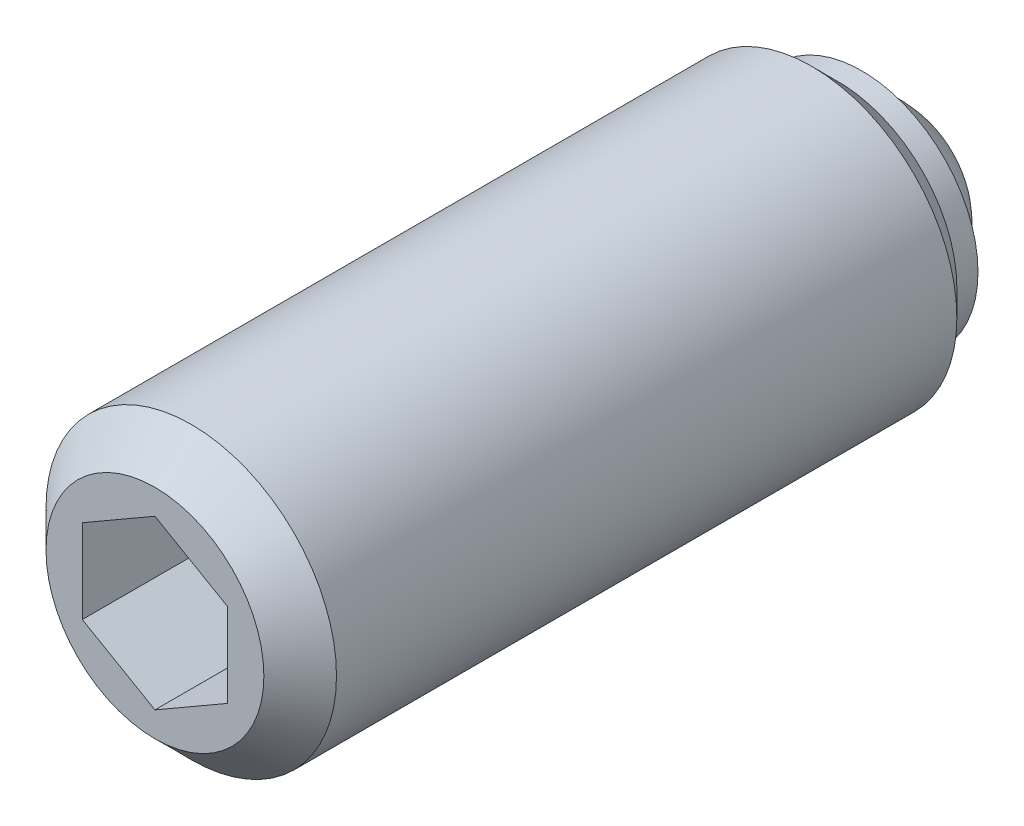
ISO-10303-21;
HEADER;
FILE_DESCRIPTION(('STEP AP214'),'2;1');
FILE_NAME('part.step','',(''),(''),'','','');
FILE_SCHEMA(('AUTOMOTIVE_DESIGN { 1 0 10303 214 1 1 1 1 }'));
ENDSEC;
DATA;
#1=APPLICATION_CONTEXT('core data for automotive mechanical design processes');
#2=APPLICATION_PROTOCOL_DEFINITION('international standard','automotive_design',2000,#1);
#3=PRODUCT_CONTEXT('',#1,'mechanical');
#4=PRODUCT('Part','Part','',(#3));
#5=PRODUCT_RELATED_PRODUCT_CATEGORY('part','',(#4));
#6=PRODUCT_DEFINITION_FORMATION('','',#4);
#7=PRODUCT_DEFINITION_CONTEXT('part definition',#1,'design');
#8=PRODUCT_DEFINITION('design','',#6,#7);
#9=PRODUCT_DEFINITION_SHAPE('','',#8);
#10=(LENGTH_UNIT() NAMED_UNIT(*) SI_UNIT(.MILLI.,.METRE.));
#11=(NAMED_UNIT(*) PLANE_ANGLE_UNIT() SI_UNIT($,.RADIAN.));
#12=(NAMED_UNIT(*) SI_UNIT($,.STERADIAN.) SOLID_ANGLE_UNIT());
#13=UNCERTAINTY_MEASURE_WITH_UNIT(LENGTH_MEASURE(1.E-05),#10,'distance_accuracy_value','');
#14=(GEOMETRIC_REPRESENTATION_CONTEXT(3) GLOBAL_UNCERTAINTY_ASSIGNED_CONTEXT((#13)) GLOBAL_UNIT_ASSIGNED_CONTEXT((#10,
#11,#12)) REPRESENTATION_CONTEXT('',''));
#15=CARTESIAN_POINT('',(0.,0.,0.));
#16=DIRECTION('',(0.,0.,1.));
#17=DIRECTION('',(1.,0.,0.));
#18=AXIS2_PLACEMENT_3D('',#15,#16,#17);
#19=CARTESIAN_POINT('',(0.,0.,24.));
#20=DIRECTION('',(0.,0.,-1.));
#21=DIRECTION('',(-1.,0.,0.));
#22=AXIS2_PLACEMENT_3D('',#19,#20,#21);
#23=PLANE('',#22);
#24=DIRECTION('',(0.,1.,0.));
#25=VECTOR('',#24,1.);
#26=CARTESIAN_POINT('',(-3.,-1.73205080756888,24.));
#27=LINE('',#26,#25);
#28=CARTESIAN_POINT('',(-3.,-1.73205080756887,24.));
#29=VERTEX_POINT('',#28);
#30=CARTESIAN_POINT('',(-3.,1.73205080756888,24.));
#31=VERTEX_POINT('',#30);
#32=EDGE_CURVE('E80',#29,#31,#27,.T.);
#33=ORIENTED_EDGE('',*,*,#32,.F.);
#34=DIRECTION('',(0.866025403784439,-0.5,0.));
#35=VECTOR('',#34,1.);
#36=CARTESIAN_POINT('',(0.,-3.46410161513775,24.));
#37=LINE('',#36,#35);
#38=CARTESIAN_POINT('',(0.,-3.46410161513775,24.));
#39=VERTEX_POINT('',#38);
#40=EDGE_CURVE('E102',#39,#29,#37,.F.);
#41=ORIENTED_EDGE('',*,*,#40,.F.);
#42=DIRECTION('',(-0.866025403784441,-0.5,0.));
#43=VECTOR('',#42,1.);
#44=CARTESIAN_POINT('',(1.5,-2.59807621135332,24.));
#45=LINE('',#44,#43);
#46=CARTESIAN_POINT('',(3.,-1.73205080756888,24.));
#47=VERTEX_POINT('',#46);
#48=EDGE_CURVE('E81',#47,#39,#45,.T.);
#49=ORIENTED_EDGE('',*,*,#48,.F.);
#50=DIRECTION('',(0.,1.,0.));
#51=VECTOR('',#50,1.);
#52=CARTESIAN_POINT('',(3.,0.,24.));
#53=LINE('',#52,#51);
#54=CARTESIAN_POINT('',(3.,1.73205080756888,24.));
#55=VERTEX_POINT('',#54);
#56=EDGE_CURVE('E64',#55,#47,#53,.F.);
#57=ORIENTED_EDGE('',*,*,#56,.F.);
#58=DIRECTION('',(0.866025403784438,-0.5,0.));
#59=VECTOR('',#58,1.);
#60=CARTESIAN_POINT('',(1.5,2.59807621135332,24.));
#61=LINE('',#60,#59);
#62=CARTESIAN_POINT('',(0.,3.46410161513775,24.));
#63=VERTEX_POINT('',#62);
#64=EDGE_CURVE('E67',#63,#55,#61,.T.);
#65=ORIENTED_EDGE('',*,*,#64,.F.);
#66=DIRECTION('',(0.866025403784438,0.5,0.));
#67=VECTOR('',#66,1.);
#68=CARTESIAN_POINT('',(-3.,1.73205080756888,24.));
#69=LINE('',#68,#67);
#70=EDGE_CURVE('E69',#31,#63,#69,.T.);
#71=ORIENTED_EDGE('',*,*,#70,.F.);
#72=EDGE_LOOP('',(#33,#41,#49,#57,#65,#71));
#73=FACE_BOUND('',#72,.T.);
#74=ADVANCED_FACE('F14',(#73),#23,.F.);
#75=CARTESIAN_POINT('',(-3.,-1.73205080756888,24.));
#76=DIRECTION('',(1.,0.,0.));
#77=DIRECTION('',(0.,0.,-1.));
#78=AXIS2_PLACEMENT_3D('',#75,#76,#77);
#79=PLANE('',#78);
#80=ORIENTED_EDGE('',*,*,#32,.T.);
#81=DIRECTION('',(0.,0.,-1.));
#82=VECTOR('',#81,1.);
#83=CARTESIAN_POINT('',(-3.,1.73205080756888,24.));
#84=LINE('',#83,#82);
#85=CARTESIAN_POINT('',(-3.,1.73205080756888,32.));
#86=VERTEX_POINT('',#85);
#87=EDGE_CURVE('E79',#86,#31,#84,.T.);
#88=ORIENTED_EDGE('',*,*,#87,.F.);
#89=DIRECTION('',(0.,1.,0.));
#90=VECTOR('',#89,1.);
#91=CARTESIAN_POINT('',(-3.,0.,32.));
#92=LINE('',#91,#90);
#93=CARTESIAN_POINT('',(-3.,-1.73205080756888,32.));
#94=VERTEX_POINT('',#93);
#95=EDGE_CURVE('E84',#86,#94,#92,.F.);
#96=ORIENTED_EDGE('',*,*,#95,.T.);
#97=DIRECTION('',(0.,0.,-1.));
#98=VECTOR('',#97,1.);
#99=CARTESIAN_POINT('',(-3.,-1.73205080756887,24.));
#100=LINE('',#99,#98);
#101=EDGE_CURVE('E96',#29,#94,#100,.F.);
#102=ORIENTED_EDGE('',*,*,#101,.F.);
#103=EDGE_LOOP('',(#80,#88,#96,#102));
#104=FACE_BOUND('',#103,.T.);
#105=ADVANCED_FACE('F169',(#104),#79,.T.);
#106=CARTESIAN_POINT('',(0.,-3.46410161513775,24.));
#107=DIRECTION('',(0.5,0.866025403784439,0.));
#108=DIRECTION('',(0.866025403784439,-0.5,0.));
#109=AXIS2_PLACEMENT_3D('',#106,#107,#108);
#110=PLANE('',#109);
#111=ORIENTED_EDGE('',*,*,#40,.T.);
#112=ORIENTED_EDGE('',*,*,#101,.T.);
#113=DIRECTION('',(0.86602540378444,-0.5,0.));
#114=VECTOR('',#113,1.);
#115=CARTESIAN_POINT('',(-3.,-1.73205080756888,32.));
#116=LINE('',#115,#114);
#117=CARTESIAN_POINT('',(0.,-3.46410161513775,32.));
#118=VERTEX_POINT('',#117);
#119=EDGE_CURVE('E85',#94,#118,#116,.T.);
#120=ORIENTED_EDGE('',*,*,#119,.T.);
#121=DIRECTION('',(0.,0.,-1.));
#122=VECTOR('',#121,1.);
#123=CARTESIAN_POINT('',(0.,-3.46410161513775,24.));
#124=LINE('',#123,#122);
#125=EDGE_CURVE('E94',#39,#118,#124,.F.);
#126=ORIENTED_EDGE('',*,*,#125,.F.);
#127=EDGE_LOOP('',(#111,#112,#120,#126));
#128=FACE_BOUND('',#127,.T.);
#129=ADVANCED_FACE('F173',(#128),#110,.T.);
#130=CARTESIAN_POINT('',(3.,-1.73205080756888,24.));
#131=DIRECTION('',(-0.5,0.866025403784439,0.));
#132=DIRECTION('',(0.866025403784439,0.5,0.));
#133=AXIS2_PLACEMENT_3D('',#130,#131,#132);
#134=PLANE('',#133);
#135=ORIENTED_EDGE('',*,*,#48,.T.);
#136=ORIENTED_EDGE('',*,*,#125,.T.);
#137=DIRECTION('',(0.86602540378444,0.5,0.));
#138=VECTOR('',#137,1.);
#139=CARTESIAN_POINT('',(0.,-3.46410161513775,32.));
#140=LINE('',#139,#138);
#141=CARTESIAN_POINT('',(3.,-1.73205080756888,32.));
#142=VERTEX_POINT('',#141);
#143=EDGE_CURVE('E108',#118,#142,#140,.T.);
#144=ORIENTED_EDGE('',*,*,#143,.T.);
#145=DIRECTION('',(0.,0.,1.));
#146=VECTOR('',#145,1.);
#147=CARTESIAN_POINT('',(3.,-1.73205080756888,24.));
#148=LINE('',#147,#146);
#149=EDGE_CURVE('E91',#47,#142,#148,.T.);
#150=ORIENTED_EDGE('',*,*,#149,.F.);
#151=EDGE_LOOP('',(#135,#136,#144,#150));
#152=FACE_BOUND('',#151,.T.);
#153=ADVANCED_FACE('F178',(#152),#134,.T.);
#154=CARTESIAN_POINT('',(3.,1.73205080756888,24.));
#155=DIRECTION('',(-1.,0.,0.));
#156=DIRECTION('',(0.,0.,1.));
#157=AXIS2_PLACEMENT_3D('',#154,#155,#156);
#158=PLANE('',#157);
#159=ORIENTED_EDGE('',*,*,#56,.T.);
#160=ORIENTED_EDGE('',*,*,#149,.T.);
#161=DIRECTION('',(0.,1.,0.));
#162=VECTOR('',#161,1.);
#163=CARTESIAN_POINT('',(3.,0.,32.));
#164=LINE('',#163,#162);
#165=CARTESIAN_POINT('',(3.,1.73205080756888,32.));
#166=VERTEX_POINT('',#165);
#167=EDGE_CURVE('E110',#142,#166,#164,.T.);
#168=ORIENTED_EDGE('',*,*,#167,.T.);
#169=DIRECTION('',(0.,0.,-1.));
#170=VECTOR('',#169,1.);
#171=CARTESIAN_POINT('',(3.,1.73205080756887,24.));
#172=LINE('',#171,#170);
#173=EDGE_CURVE('E87',#55,#166,#172,.F.);
#174=ORIENTED_EDGE('',*,*,#173,.F.);
#175=EDGE_LOOP('',(#159,#160,#168,#174));
#176=FACE_BOUND('',#175,.T.);
#177=ADVANCED_FACE('F184',(#176),#158,.T.);
#178=CARTESIAN_POINT('',(0.,3.46410161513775,24.));
#179=DIRECTION('',(-0.5,-0.866025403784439,0.));
#180=DIRECTION('',(-0.866025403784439,0.5,0.));
#181=AXIS2_PLACEMENT_3D('',#178,#179,#180);
#182=PLANE('',#181);
#183=ORIENTED_EDGE('',*,*,#64,.T.);
#184=ORIENTED_EDGE('',*,*,#173,.T.);
#185=DIRECTION('',(-0.86602540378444,0.5,0.));
#186=VECTOR('',#185,1.);
#187=CARTESIAN_POINT('',(3.,1.73205080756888,32.));
#188=LINE('',#187,#186);
#189=CARTESIAN_POINT('',(0.,3.46410161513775,32.));
#190=VERTEX_POINT('',#189);
#191=EDGE_CURVE('E31',#166,#190,#188,.T.);
#192=ORIENTED_EDGE('',*,*,#191,.T.);
#193=DIRECTION('',(0.,0.,-1.));
#194=VECTOR('',#193,1.);
#195=CARTESIAN_POINT('',(0.,3.46410161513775,24.));
#196=LINE('',#195,#194);
#197=EDGE_CURVE('E77',#63,#190,#196,.F.);
#198=ORIENTED_EDGE('',*,*,#197,.F.);
#199=EDGE_LOOP('',(#183,#184,#192,#198));
#200=FACE_BOUND('',#199,.T.);
#201=ADVANCED_FACE('F83',(#200),#182,.T.);
#202=CARTESIAN_POINT('',(-3.,1.73205080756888,24.));
#203=DIRECTION('',(0.5,-0.866025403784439,0.));
#204=DIRECTION('',(-0.866025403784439,-0.5,0.));
#205=AXIS2_PLACEMENT_3D('',#202,#203,#204);
#206=PLANE('',#205);
#207=ORIENTED_EDGE('',*,*,#70,.T.);
#208=ORIENTED_EDGE('',*,*,#197,.T.);
#209=DIRECTION('',(-0.86602540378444,-0.5,0.));
#210=VECTOR('',#209,1.);
#211=CARTESIAN_POINT('',(0.,3.46410161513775,32.));
#212=LINE('',#211,#210);
#213=EDGE_CURVE('E113',#190,#86,#212,.T.);
#214=ORIENTED_EDGE('',*,*,#213,.T.);
#215=ORIENTED_EDGE('',*,*,#87,.T.);
#216=EDGE_LOOP('',(#207,#208,#214,#215));
#217=FACE_BOUND('',#216,.T.);
#218=ADVANCED_FACE('F75',(#217),#206,.T.);
#219=CARTESIAN_POINT('',(0.,0.,32.));
#220=DIRECTION('',(0.,0.,-1.));
#221=DIRECTION('',(-1.,0.,0.));
#222=AXIS2_PLACEMENT_3D('',#219,#220,#221);
#223=PLANE('',#222);
#224=ORIENTED_EDGE('',*,*,#191,.F.);
#225=ORIENTED_EDGE('',*,*,#167,.F.);
#226=ORIENTED_EDGE('',*,*,#143,.F.);
#227=ORIENTED_EDGE('',*,*,#119,.F.);
#228=ORIENTED_EDGE('',*,*,#95,.F.);
#229=ORIENTED_EDGE('',*,*,#213,.F.);
#230=EDGE_LOOP('',(#224,#225,#226,#227,#228,#229));
#231=FACE_BOUND('',#230,.T.);
#232=CARTESIAN_POINT('',(0.,0.,32.));
#233=DIRECTION('',(0.,0.,-1.));
#234=DIRECTION('',(-1.,0.,0.));
#235=AXIS2_PLACEMENT_3D('',#232,#233,#234);
#236=CIRCLE('',#235,4.50000000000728);
#237=CARTESIAN_POINT('',(-4.50000000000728,0.,32.));
#238=VERTEX_POINT('',#237);
#239=EDGE_CURVE('E17',#238,#238,#236,.T.);
#240=ORIENTED_EDGE('',*,*,#239,.F.);
#241=EDGE_LOOP('',(#240));
#242=FACE_BOUND('',#241,.T.);
#243=ADVANCED_FACE('F193',(#231,#242),#223,.F.);
#244=CARTESIAN_POINT('',(0.,0.,30.4999999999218));
#245=DIRECTION('',(0.,0.,-1.));
#246=DIRECTION('',(-1.,0.,0.));
#247=AXIS2_PLACEMENT_3D('',#244,#245,#246);
#248=CONICAL_SURFACE('',#247,6.00000000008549,0.785398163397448);
#249=ORIENTED_EDGE('',*,*,#239,.T.);
#250=EDGE_LOOP('',(#249));
#251=FACE_BOUND('',#250,.T.);
#252=CARTESIAN_POINT('',(0.,0.,30.5));
#253=DIRECTION('',(0.,0.,1.));
#254=DIRECTION('',(1.,0.,0.));
#255=AXIS2_PLACEMENT_3D('',#252,#253,#254);
#256=CIRCLE('',#255,6.);
#257=CARTESIAN_POINT('',(6.,0.,30.5));
#258=VERTEX_POINT('',#257);
#259=EDGE_CURVE('E9',#258,#258,#256,.F.);
#260=ORIENTED_EDGE('',*,*,#259,.F.);
#261=EDGE_LOOP('',(#260));
#262=FACE_BOUND('',#261,.T.);
#263=ADVANCED_FACE('F165',(#251,#262),#248,.T.);
#264=CARTESIAN_POINT('',(0.,0.,16.8));
#265=DIRECTION('',(0.,0.,1.));
#266=DIRECTION('',(1.,0.,0.));
#267=AXIS2_PLACEMENT_3D('',#264,#265,#266);
#268=CYLINDRICAL_SURFACE('',#267,6.);
#269=ORIENTED_EDGE('',*,*,#259,.T.);
#270=EDGE_LOOP('',(#269));
#271=FACE_BOUND('',#270,.T.);
#272=CARTESIAN_POINT('',(0.,0.,4.87350000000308));
#273=DIRECTION('',(0.,0.,1.));
#274=DIRECTION('',(1.,0.,0.));
#275=AXIS2_PLACEMENT_3D('',#272,#273,#274);
#276=CIRCLE('',#275,6.);
#277=CARTESIAN_POINT('',(6.,0.,4.87350000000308));
#278=VERTEX_POINT('',#277);
#279=EDGE_CURVE('E128',#278,#278,#276,.T.);
#280=ORIENTED_EDGE('',*,*,#279,.T.);
#281=EDGE_LOOP('',(#280));
#282=FACE_BOUND('',#281,.T.);
#283=ADVANCED_FACE('F132',(#271,#282),#268,.T.);
#284=CARTESIAN_POINT('',(0.,0.,4.25));
#285=DIRECTION('',(0.,0.,1.));
#286=DIRECTION('',(0.,1.,0.));
#287=AXIS2_PLACEMENT_3D('',#284,#285,#286);
#288=SPHERICAL_SURFACE('',#287,4.25);
#289=CARTESIAN_POINT('',(0.,0.,2.8));
#290=DIRECTION('',(0.,0.,1.));
#291=DIRECTION('',(1.,0.,0.));
#292=AXIS2_PLACEMENT_3D('',#289,#290,#291);
#293=CIRCLE('',#292,3.99499687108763);
#294=CARTESIAN_POINT('',(3.99499687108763,0.,2.8));
#295=VERTEX_POINT('',#294);
#296=EDGE_CURVE('E71',#295,#295,#293,.T.);
#297=ORIENTED_EDGE('',*,*,#296,.F.);
#298=EDGE_LOOP('',(#297));
#299=FACE_BOUND('',#298,.T.);
#300=ADVANCED_FACE('F155',(#299),#288,.T.);
#301=CARTESIAN_POINT('',(0.,3.99499687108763,2.8));
#302=DIRECTION('',(0.,0.,1.));
#303=DIRECTION('',(1.,0.,0.));
#304=AXIS2_PLACEMENT_3D('',#301,#302,#303);
#305=PLANE('',#304);
#306=CARTESIAN_POINT('',(0.,0.,2.8));
#307=DIRECTION('',(0.,0.,1.));
#308=DIRECTION('',(1.,0.,0.));
#309=AXIS2_PLACEMENT_3D('',#306,#307,#308);
#310=CIRCLE('',#309,4.80000000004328);
#311=CARTESIAN_POINT('',(4.80000000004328,0.,2.8));
#312=VERTEX_POINT('',#311);
#313=EDGE_CURVE('E119',#312,#312,#310,.T.);
#314=ORIENTED_EDGE('',*,*,#313,.F.);
#315=EDGE_LOOP('',(#314));
#316=FACE_BOUND('',#315,.T.);
#317=ORIENTED_EDGE('',*,*,#296,.T.);
#318=EDGE_LOOP('',(#317));
#319=FACE_BOUND('',#318,.T.);
#320=ADVANCED_FACE('F149',(#316,#319),#305,.F.);
#321=CARTESIAN_POINT('',(0.,0.,37.3342905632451));
#322=DIRECTION('',(0.,0.,1.));
#323=DIRECTION('',(1.,0.,0.));
#324=AXIS2_PLACEMENT_3D('',#321,#322,#323);
#325=CYLINDRICAL_SURFACE('',#324,4.80000000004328);
#326=CARTESIAN_POINT('',(0.,0.,3.8));
#327=DIRECTION('',(0.,0.,1.));
#328=DIRECTION('',(1.,0.,0.));
#329=AXIS2_PLACEMENT_3D('',#326,#327,#328);
#330=CIRCLE('',#329,4.80000000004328);
#331=CARTESIAN_POINT('',(4.80000000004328,0.,3.8));
#332=VERTEX_POINT('',#331);
#333=EDGE_CURVE('E122',#332,#332,#330,.T.);
#334=ORIENTED_EDGE('',*,*,#333,.F.);
#335=EDGE_LOOP('',(#334));
#336=FACE_BOUND('',#335,.T.);
#337=ORIENTED_EDGE('',*,*,#313,.T.);
#338=EDGE_LOOP('',(#337));
#339=FACE_BOUND('',#338,.T.);
#340=ADVANCED_FACE('F143',(#336,#339),#325,.T.);
#341=CARTESIAN_POINT('',(0.,4.80000000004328,3.8));
#342=DIRECTION('',(0.,0.,1.));
#343=DIRECTION('',(1.,0.,0.));
#344=AXIS2_PLACEMENT_3D('',#341,#342,#343);
#345=PLANE('',#344);
#346=CARTESIAN_POINT('',(0.,0.,3.8));
#347=DIRECTION('',(0.,0.,1.));
#348=DIRECTION('',(1.,0.,0.));
#349=AXIS2_PLACEMENT_3D('',#346,#347,#348);
#350=CIRCLE('',#349,4.92649999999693);
#351=CARTESIAN_POINT('',(4.92649999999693,0.,3.8));
#352=VERTEX_POINT('',#351);
#353=EDGE_CURVE('E125',#352,#352,#350,.T.);
#354=ORIENTED_EDGE('',*,*,#353,.F.);
#355=EDGE_LOOP('',(#354));
#356=FACE_BOUND('',#355,.T.);
#357=ORIENTED_EDGE('',*,*,#333,.T.);
#358=EDGE_LOOP('',(#357));
#359=FACE_BOUND('',#358,.T.);
#360=ADVANCED_FACE('F137',(#356,#359),#345,.F.);
#361=CARTESIAN_POINT('',(0.,0.,3.8));
#362=DIRECTION('',(0.,0.,1.));
#363=DIRECTION('',(1.,0.,0.));
#364=AXIS2_PLACEMENT_3D('',#361,#362,#363);
#365=CONICAL_SURFACE('',#364,4.92649999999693,0.78539816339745);
#366=ORIENTED_EDGE('',*,*,#279,.F.);
#367=EDGE_LOOP('',(#366));
#368=FACE_BOUND('',#367,.T.);
#369=ORIENTED_EDGE('',*,*,#353,.T.);
#370=EDGE_LOOP('',(#369));
#371=FACE_BOUND('',#370,.T.);
#372=ADVANCED_FACE('F134',(#368,#371),#365,.T.);
#373=CLOSED_SHELL('',(#74,#105,#129,#153,#177,#201,#218,#243,#263,#283,#300,#320,#340,#360,#372));
#374=MANIFOLD_SOLID_BREP('B1',#373);
#375=ADVANCED_BREP_SHAPE_REPRESENTATION('',(#18,#374),#14);
#376=SHAPE_DEFINITION_REPRESENTATION(#9,#375);
ENDSEC;
END-ISO-10303-21;
